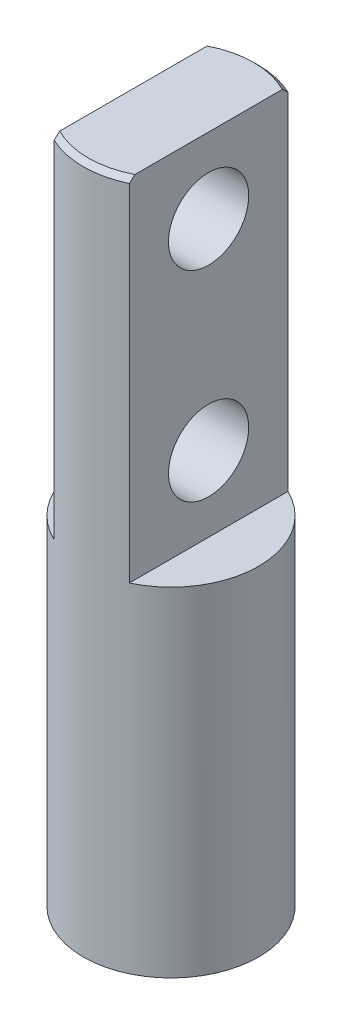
ISO-10303-21;
HEADER;
FILE_DESCRIPTION(('STEP AP214'),'2;1');
FILE_NAME('part.step','',(''),(''),'','','');
FILE_SCHEMA(('AUTOMOTIVE_DESIGN { 1 0 10303 214 1 1 1 1 }'));
ENDSEC;
DATA;
#1=APPLICATION_CONTEXT('core data for automotive mechanical design processes');
#2=APPLICATION_PROTOCOL_DEFINITION('international standard','automotive_design',2000,#1);
#3=PRODUCT_CONTEXT('',#1,'mechanical');
#4=PRODUCT('Part','Part','',(#3));
#5=PRODUCT_RELATED_PRODUCT_CATEGORY('part','',(#4));
#6=PRODUCT_DEFINITION_FORMATION('','',#4);
#7=PRODUCT_DEFINITION_CONTEXT('part definition',#1,'design');
#8=PRODUCT_DEFINITION('design','',#6,#7);
#9=PRODUCT_DEFINITION_SHAPE('','',#8);
#10=(LENGTH_UNIT() NAMED_UNIT(*) SI_UNIT(.MILLI.,.METRE.));
#11=(NAMED_UNIT(*) PLANE_ANGLE_UNIT() SI_UNIT($,.RADIAN.));
#12=(NAMED_UNIT(*) SI_UNIT($,.STERADIAN.) SOLID_ANGLE_UNIT());
#13=UNCERTAINTY_MEASURE_WITH_UNIT(LENGTH_MEASURE(1.E-05),#10,'distance_accuracy_value','');
#14=(GEOMETRIC_REPRESENTATION_CONTEXT(3) GLOBAL_UNCERTAINTY_ASSIGNED_CONTEXT((#13)) GLOBAL_UNIT_ASSIGNED_CONTEXT((#10,
#11,#12)) REPRESENTATION_CONTEXT('',''));
#15=CARTESIAN_POINT('',(0.,0.,0.));
#16=DIRECTION('',(0.,0.,1.));
#17=DIRECTION('',(1.,0.,0.));
#18=AXIS2_PLACEMENT_3D('',#15,#16,#17);
#19=CARTESIAN_POINT('',(0.,0.,0.));
#20=DIRECTION('',(0.,1.,0.));
#21=DIRECTION('',(0.,0.,1.));
#22=AXIS2_PLACEMENT_3D('',#19,#20,#21);
#23=PLANE('',#22);
#24=DIRECTION('',(0.,0.,1.));
#25=VECTOR('',#24,1.);
#26=CARTESIAN_POINT('',(-1.5,0.,3.16227766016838));
#27=LINE('',#26,#25);
#28=CARTESIAN_POINT('',(-1.5,0.,-3.16227766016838));
#29=VERTEX_POINT('',#28);
#30=CARTESIAN_POINT('',(-1.5,0.,3.16227766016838));
#31=VERTEX_POINT('',#30);
#32=EDGE_CURVE('E109',#29,#31,#27,.T.);
#33=ORIENTED_EDGE('',*,*,#32,.F.);
#34=CARTESIAN_POINT('',(0.,0.,0.));
#35=DIRECTION('',(0.,1.,0.));
#36=DIRECTION('',(0.,0.,1.));
#37=AXIS2_PLACEMENT_3D('',#34,#35,#36);
#38=CIRCLE('',#37,3.5);
#39=EDGE_CURVE('E105',#29,#31,#38,.T.);
#40=ORIENTED_EDGE('',*,*,#39,.T.);
#41=EDGE_LOOP('',(#33,#40));
#42=FACE_BOUND('',#41,.T.);
#43=ADVANCED_FACE('F32',(#42),#23,.T.);
#44=CARTESIAN_POINT('',(0.,-13.5,0.));
#45=DIRECTION('',(0.,1.,0.));
#46=DIRECTION('',(0.,0.,1.));
#47=AXIS2_PLACEMENT_3D('',#44,#45,#46);
#48=CYLINDRICAL_SURFACE('',#47,3.5);
#49=CARTESIAN_POINT('',(0.,-13.5,0.));
#50=DIRECTION('',(0.,1.,0.));
#51=DIRECTION('',(0.,0.,1.));
#52=AXIS2_PLACEMENT_3D('',#49,#50,#51);
#53=CIRCLE('',#52,3.5);
#54=CARTESIAN_POINT('',(0.,-13.5,3.5));
#55=VERTEX_POINT('',#54);
#56=EDGE_CURVE('E104',#55,#55,#53,.T.);
#57=ORIENTED_EDGE('',*,*,#56,.T.);
#58=EDGE_LOOP('',(#57));
#59=FACE_BOUND('',#58,.T.);
#60=DIRECTION('',(0.,-1.,0.));
#61=VECTOR('',#60,1.);
#62=CARTESIAN_POINT('',(1.5,14.,3.16227766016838));
#63=LINE('',#62,#61);
#64=CARTESIAN_POINT('',(1.5,13.8,3.16227766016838));
#65=VERTEX_POINT('',#64);
#66=CARTESIAN_POINT('',(1.5,0.,3.16227766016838));
#67=VERTEX_POINT('',#66);
#68=EDGE_CURVE('E97',#65,#67,#63,.T.);
#69=ORIENTED_EDGE('',*,*,#68,.F.);
#70=CARTESIAN_POINT('',(0.,13.8,0.));
#71=DIRECTION('',(0.,1.,0.));
#72=DIRECTION('',(0.,0.,1.));
#73=AXIS2_PLACEMENT_3D('',#70,#71,#72);
#74=CIRCLE('',#73,3.5);
#75=CARTESIAN_POINT('',(-1.5,13.8,3.16227766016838));
#76=VERTEX_POINT('',#75);
#77=EDGE_CURVE('E59',#65,#76,#74,.F.);
#78=ORIENTED_EDGE('',*,*,#77,.T.);
#79=DIRECTION('',(0.,-1.,0.));
#80=VECTOR('',#79,1.);
#81=CARTESIAN_POINT('',(-1.5,14.,3.16227766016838));
#82=LINE('',#81,#80);
#83=EDGE_CURVE('E138',#76,#31,#82,.T.);
#84=ORIENTED_EDGE('',*,*,#83,.T.);
#85=ORIENTED_EDGE('',*,*,#39,.F.);
#86=DIRECTION('',(0.,-1.,0.));
#87=VECTOR('',#86,1.);
#88=CARTESIAN_POINT('',(-1.5,14.,-3.16227766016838));
#89=LINE('',#88,#87);
#90=CARTESIAN_POINT('',(-1.5,13.8,-3.16227766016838));
#91=VERTEX_POINT('',#90);
#92=EDGE_CURVE('E98',#91,#29,#89,.T.);
#93=ORIENTED_EDGE('',*,*,#92,.F.);
#94=CARTESIAN_POINT('',(0.,13.8,0.));
#95=DIRECTION('',(0.,1.,0.));
#96=DIRECTION('',(0.,0.,1.));
#97=AXIS2_PLACEMENT_3D('',#94,#95,#96);
#98=CIRCLE('',#97,3.5);
#99=CARTESIAN_POINT('',(1.5,13.8,-3.16227766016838));
#100=VERTEX_POINT('',#99);
#101=EDGE_CURVE('E93',#91,#100,#98,.F.);
#102=ORIENTED_EDGE('',*,*,#101,.T.);
#103=DIRECTION('',(0.,-1.,0.));
#104=VECTOR('',#103,1.);
#105=CARTESIAN_POINT('',(1.5,14.,-3.16227766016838));
#106=LINE('',#105,#104);
#107=CARTESIAN_POINT('',(1.5,0.,-3.16227766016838));
#108=VERTEX_POINT('',#107);
#109=EDGE_CURVE('E88',#100,#108,#106,.T.);
#110=ORIENTED_EDGE('',*,*,#109,.T.);
#111=EDGE_CURVE('E91',#67,#108,#38,.T.);
#112=ORIENTED_EDGE('',*,*,#111,.F.);
#113=EDGE_LOOP('',(#69,#78,#84,#85,#93,#102,#110,#112));
#114=FACE_BOUND('',#113,.T.);
#115=ADVANCED_FACE('F90',(#59,#114),#48,.T.);
#116=CARTESIAN_POINT('',(0.,-13.5,0.));
#117=DIRECTION('',(0.,1.,0.));
#118=DIRECTION('',(0.,0.,1.));
#119=AXIS2_PLACEMENT_3D('',#116,#117,#118);
#120=PLANE('',#119);
#121=ORIENTED_EDGE('',*,*,#56,.F.);
#122=EDGE_LOOP('',(#121));
#123=FACE_BOUND('',#122,.T.);
#124=ADVANCED_FACE('F164',(#123),#120,.F.);
#125=DIRECTION('',(0.,0.,-1.));
#126=VECTOR('',#125,1.);
#127=CARTESIAN_POINT('',(1.5,0.,3.16227766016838));
#128=LINE('',#127,#126);
#129=EDGE_CURVE('E103',#67,#108,#128,.T.);
#130=ORIENTED_EDGE('',*,*,#129,.F.);
#131=ORIENTED_EDGE('',*,*,#111,.T.);
#132=EDGE_LOOP('',(#130,#131));
#133=FACE_BOUND('',#132,.T.);
#134=ADVANCED_FACE('F102',(#133),#23,.T.);
#135=CARTESIAN_POINT('',(1.5,14.,3.16227766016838));
#136=DIRECTION('',(-1.,0.,0.));
#137=DIRECTION('',(0.,0.,1.));
#138=AXIS2_PLACEMENT_3D('',#135,#136,#137);
#139=PLANE('',#138);
#140=CARTESIAN_POINT('',(1.5,3.,0.));
#141=DIRECTION('',(1.,0.,0.));
#142=DIRECTION('',(0.,0.,-1.));
#143=AXIS2_PLACEMENT_3D('',#140,#141,#142);
#144=CIRCLE('',#143,1.6);
#145=CARTESIAN_POINT('',(1.5,3.,-1.6));
#146=VERTEX_POINT('',#145);
#147=EDGE_CURVE('E218',#146,#146,#144,.T.);
#148=ORIENTED_EDGE('',*,*,#147,.F.);
#149=EDGE_LOOP('',(#148));
#150=FACE_BOUND('',#149,.T.);
#151=CARTESIAN_POINT('',(1.5,11.,0.));
#152=DIRECTION('',(1.,0.,0.));
#153=DIRECTION('',(0.,0.,-1.));
#154=AXIS2_PLACEMENT_3D('',#151,#152,#153);
#155=CIRCLE('',#154,1.6);
#156=CARTESIAN_POINT('',(1.5,11.,-1.6));
#157=VERTEX_POINT('',#156);
#158=EDGE_CURVE('E116',#157,#157,#155,.T.);
#159=ORIENTED_EDGE('',*,*,#158,.F.);
#160=EDGE_LOOP('',(#159));
#161=FACE_BOUND('',#160,.T.);
#162=DIRECTION('',(0.,0.,-1.));
#163=VECTOR('',#162,1.);
#164=CARTESIAN_POINT('',(1.5,14.,3.16227766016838));
#165=LINE('',#164,#163);
#166=CARTESIAN_POINT('',(1.5,14.,2.93938769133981));
#167=VERTEX_POINT('',#166);
#168=CARTESIAN_POINT('',(1.5,14.,-2.93938769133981));
#169=VERTEX_POINT('',#168);
#170=EDGE_CURVE('E113',#167,#169,#165,.T.);
#171=ORIENTED_EDGE('',*,*,#170,.F.);
#172=CARTESIAN_POINT('',(1.5,14.,2.93938769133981));
#173=CARTESIAN_POINT('',(1.5,13.96679809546,2.97665395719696));
#174=CARTESIAN_POINT('',(1.5,13.9335304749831,3.01386125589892));
#175=CARTESIAN_POINT('',(1.5,13.8668638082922,3.08815791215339));
#176=CARTESIAN_POINT('',(1.5,13.8334647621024,3.12524726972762));
#177=CARTESIAN_POINT('',(1.5,13.8,3.16227766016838));
#178=B_SPLINE_CURVE_WITH_KNOTS('',3,(#172,#173,#174,#175,#176,#177),.UNSPECIFIED.,.F.,.F.,(4,2,
4),(0.,0.149733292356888,0.29946655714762),.UNSPECIFIED.);
#179=EDGE_CURVE('E141',#167,#65,#178,.T.);
#180=ORIENTED_EDGE('',*,*,#179,.T.);
#181=ORIENTED_EDGE('',*,*,#68,.T.);
#182=ORIENTED_EDGE('',*,*,#129,.T.);
#183=ORIENTED_EDGE('',*,*,#109,.F.);
#184=CARTESIAN_POINT('',(1.5,13.8,-3.16227766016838));
#185=CARTESIAN_POINT('',(1.5,13.8334647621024,-3.12524726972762));
#186=CARTESIAN_POINT('',(1.5,13.8668638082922,-3.08815791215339));
#187=CARTESIAN_POINT('',(1.5,13.9335304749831,-3.01386125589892));
#188=CARTESIAN_POINT('',(1.5,13.96679809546,-2.97665395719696));
#189=CARTESIAN_POINT('',(1.5,14.,-2.93938769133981));
#190=B_SPLINE_CURVE_WITH_KNOTS('',3,(#184,#185,#186,#187,#188,#189),.UNSPECIFIED.,.F.,.F.,(4,2,
4),(0.,0.149733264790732,0.299466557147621),.UNSPECIFIED.);
#191=EDGE_CURVE('E167',#100,#169,#190,.T.);
#192=ORIENTED_EDGE('',*,*,#191,.T.);
#193=EDGE_LOOP('',(#171,#180,#181,#182,#183,#192));
#194=FACE_BOUND('',#193,.T.);
#195=ADVANCED_FACE('F108',(#150,#161,#194),#139,.F.);
#196=CARTESIAN_POINT('',(-1.5,14.,3.16227766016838));
#197=DIRECTION('',(1.,0.,0.));
#198=DIRECTION('',(0.,0.,-1.));
#199=AXIS2_PLACEMENT_3D('',#196,#197,#198);
#200=PLANE('',#199);
#201=CARTESIAN_POINT('',(-1.5,3.,0.));
#202=DIRECTION('',(1.,0.,0.));
#203=DIRECTION('',(0.,0.,-1.));
#204=AXIS2_PLACEMENT_3D('',#201,#202,#203);
#205=CIRCLE('',#204,1.6);
#206=CARTESIAN_POINT('',(-1.5,3.,-1.6));
#207=VERTEX_POINT('',#206);
#208=EDGE_CURVE('E215',#207,#207,#205,.F.);
#209=ORIENTED_EDGE('',*,*,#208,.F.);
#210=EDGE_LOOP('',(#209));
#211=FACE_BOUND('',#210,.T.);
#212=CARTESIAN_POINT('',(-1.5,11.,0.));
#213=DIRECTION('',(1.,0.,0.));
#214=DIRECTION('',(0.,0.,-1.));
#215=AXIS2_PLACEMENT_3D('',#212,#213,#214);
#216=CIRCLE('',#215,1.6);
#217=CARTESIAN_POINT('',(-1.5,11.,-1.6));
#218=VERTEX_POINT('',#217);
#219=EDGE_CURVE('E110',#218,#218,#216,.F.);
#220=ORIENTED_EDGE('',*,*,#219,.F.);
#221=EDGE_LOOP('',(#220));
#222=FACE_BOUND('',#221,.T.);
#223=ORIENTED_EDGE('',*,*,#83,.F.);
#224=CARTESIAN_POINT('',(-1.5,13.8,3.16227766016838));
#225=CARTESIAN_POINT('',(-1.5,13.8334647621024,3.12524726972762));
#226=CARTESIAN_POINT('',(-1.5,13.8668638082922,3.08815791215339));
#227=CARTESIAN_POINT('',(-1.5,13.9335304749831,3.01386125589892));
#228=CARTESIAN_POINT('',(-1.5,13.96679809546,2.97665395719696));
#229=CARTESIAN_POINT('',(-1.5,14.,2.93938769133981));
#230=B_SPLINE_CURVE_WITH_KNOTS('',3,(#224,#225,#226,#227,#228,#229),.UNSPECIFIED.,.F.,.F.,(4,2,
4),(0.,0.149733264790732,0.299466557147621),.UNSPECIFIED.);
#231=CARTESIAN_POINT('',(-1.5,14.,2.93938769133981));
#232=VERTEX_POINT('',#231);
#233=EDGE_CURVE('E11',#76,#232,#230,.T.);
#234=ORIENTED_EDGE('',*,*,#233,.T.);
#235=DIRECTION('',(0.,0.,1.));
#236=VECTOR('',#235,1.);
#237=CARTESIAN_POINT('',(-1.5,14.,3.16227766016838));
#238=LINE('',#237,#236);
#239=CARTESIAN_POINT('',(-1.5,14.,-2.93938769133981));
#240=VERTEX_POINT('',#239);
#241=EDGE_CURVE('E127',#240,#232,#238,.T.);
#242=ORIENTED_EDGE('',*,*,#241,.F.);
#243=CARTESIAN_POINT('',(-1.5,14.,-2.93938769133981));
#244=CARTESIAN_POINT('',(-1.5,13.96679809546,-2.97665395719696));
#245=CARTESIAN_POINT('',(-1.5,13.9335304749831,-3.01386125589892));
#246=CARTESIAN_POINT('',(-1.5,13.8668638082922,-3.08815791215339));
#247=CARTESIAN_POINT('',(-1.5,13.8334647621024,-3.12524726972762));
#248=CARTESIAN_POINT('',(-1.5,13.8,-3.16227766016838));
#249=B_SPLINE_CURVE_WITH_KNOTS('',3,(#243,#244,#245,#246,#247,#248),.UNSPECIFIED.,.F.,.F.,(4,2,
4),(0.,0.149733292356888,0.29946655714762),.UNSPECIFIED.);
#250=EDGE_CURVE('E45',#240,#91,#249,.T.);
#251=ORIENTED_EDGE('',*,*,#250,.T.);
#252=ORIENTED_EDGE('',*,*,#92,.T.);
#253=ORIENTED_EDGE('',*,*,#32,.T.);
#254=EDGE_LOOP('',(#223,#234,#242,#251,#252,#253));
#255=FACE_BOUND('',#254,.T.);
#256=ADVANCED_FACE('F152',(#211,#222,#255),#200,.F.);
#257=CARTESIAN_POINT('',(0.,14.,0.));
#258=DIRECTION('',(0.,1.,0.));
#259=DIRECTION('',(0.,0.,1.));
#260=AXIS2_PLACEMENT_3D('',#257,#258,#259);
#261=PLANE('',#260);
#262=ORIENTED_EDGE('',*,*,#241,.T.);
#263=CARTESIAN_POINT('',(0.,14.,0.));
#264=DIRECTION('',(0.,1.,0.));
#265=DIRECTION('',(0.,0.,1.));
#266=AXIS2_PLACEMENT_3D('',#263,#264,#265);
#267=CIRCLE('',#266,3.3);
#268=EDGE_CURVE('E172',#232,#167,#267,.T.);
#269=ORIENTED_EDGE('',*,*,#268,.T.);
#270=ORIENTED_EDGE('',*,*,#170,.T.);
#271=CARTESIAN_POINT('',(0.,14.,0.));
#272=DIRECTION('',(0.,1.,0.));
#273=DIRECTION('',(0.,0.,1.));
#274=AXIS2_PLACEMENT_3D('',#271,#272,#273);
#275=CIRCLE('',#274,3.3);
#276=EDGE_CURVE('E175',#169,#240,#275,.T.);
#277=ORIENTED_EDGE('',*,*,#276,.T.);
#278=EDGE_LOOP('',(#262,#269,#270,#277));
#279=FACE_BOUND('',#278,.T.);
#280=ADVANCED_FACE('F156',(#279),#261,.T.);
#281=CARTESIAN_POINT('',(-6.02548339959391,11.,0.));
#282=DIRECTION('',(1.,0.,0.));
#283=DIRECTION('',(0.,0.,-1.));
#284=AXIS2_PLACEMENT_3D('',#281,#282,#283);
#285=CYLINDRICAL_SURFACE('',#284,1.6);
#286=ORIENTED_EDGE('',*,*,#219,.T.);
#287=EDGE_LOOP('',(#286));
#288=FACE_BOUND('',#287,.T.);
#289=ORIENTED_EDGE('',*,*,#158,.T.);
#290=EDGE_LOOP('',(#289));
#291=FACE_BOUND('',#290,.T.);
#292=ADVANCED_FACE('F207',(#288,#291),#285,.F.);
#293=CARTESIAN_POINT('',(-6.02548339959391,3.,0.));
#294=DIRECTION('',(1.,0.,0.));
#295=DIRECTION('',(0.,0.,-1.));
#296=AXIS2_PLACEMENT_3D('',#293,#294,#295);
#297=CYLINDRICAL_SURFACE('',#296,1.6);
#298=ORIENTED_EDGE('',*,*,#208,.T.);
#299=EDGE_LOOP('',(#298));
#300=FACE_BOUND('',#299,.T.);
#301=ORIENTED_EDGE('',*,*,#147,.T.);
#302=EDGE_LOOP('',(#301));
#303=FACE_BOUND('',#302,.T.);
#304=ADVANCED_FACE('F199',(#300,#303),#297,.F.);
#305=CARTESIAN_POINT('',(0.,14.,0.));
#306=DIRECTION('',(0.,-1.,0.));
#307=DIRECTION('',(0.,0.,-1.));
#308=AXIS2_PLACEMENT_3D('',#305,#306,#307);
#309=CONICAL_SURFACE('',#308,3.3,0.785398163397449);
#310=ORIENTED_EDGE('',*,*,#233,.F.);
#311=ORIENTED_EDGE('',*,*,#77,.F.);
#312=ORIENTED_EDGE('',*,*,#179,.F.);
#313=ORIENTED_EDGE('',*,*,#268,.F.);
#314=EDGE_LOOP('',(#310,#311,#312,#313));
#315=FACE_BOUND('',#314,.T.);
#316=ADVANCED_FACE('F196',(#315),#309,.T.);
#317=CARTESIAN_POINT('',(0.,14.,0.));
#318=DIRECTION('',(0.,-1.,0.));
#319=DIRECTION('',(0.,0.,-1.));
#320=AXIS2_PLACEMENT_3D('',#317,#318,#319);
#321=CONICAL_SURFACE('',#320,3.3,0.785398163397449);
#322=ORIENTED_EDGE('',*,*,#191,.F.);
#323=ORIENTED_EDGE('',*,*,#101,.F.);
#324=ORIENTED_EDGE('',*,*,#250,.F.);
#325=ORIENTED_EDGE('',*,*,#276,.F.);
#326=EDGE_LOOP('',(#322,#323,#324,#325));
#327=FACE_BOUND('',#326,.T.);
#328=ADVANCED_FACE('F34',(#327),#321,.T.);
#329=CLOSED_SHELL('',(#43,#115,#124,#134,#195,#256,#280,#292,#304,#316,#328));
#330=MANIFOLD_SOLID_BREP('B2',#329);
#331=ADVANCED_BREP_SHAPE_REPRESENTATION('',(#18,#330),#14);
#332=SHAPE_DEFINITION_REPRESENTATION(#9,#331);
ENDSEC;
END-ISO-10303-21;
